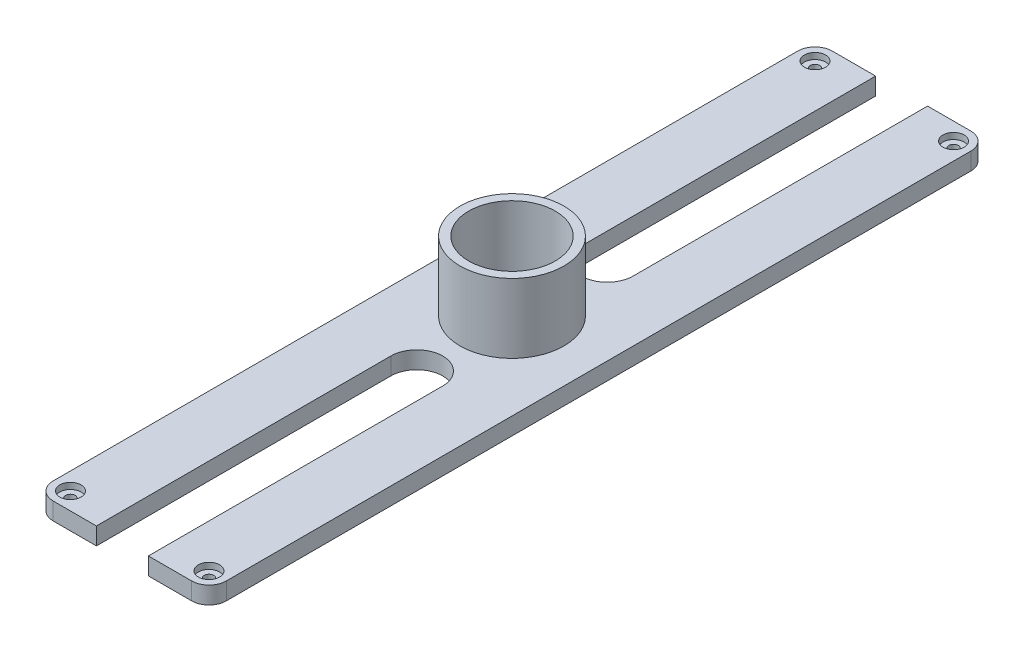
ISO-10303-21;
HEADER;
FILE_DESCRIPTION(('STEP AP214'),'2;1');
FILE_NAME('part.step','',(''),(''),'','','');
FILE_SCHEMA(('AUTOMOTIVE_DESIGN { 1 0 10303 214 1 1 1 1 }'));
ENDSEC;
DATA;
#1=APPLICATION_CONTEXT('core data for automotive mechanical design processes');
#2=APPLICATION_PROTOCOL_DEFINITION('international standard','automotive_design',2000,#1);
#3=PRODUCT_CONTEXT('',#1,'mechanical');
#4=PRODUCT('Part','Part','',(#3));
#5=PRODUCT_RELATED_PRODUCT_CATEGORY('part','',(#4));
#6=PRODUCT_DEFINITION_FORMATION('','',#4);
#7=PRODUCT_DEFINITION_CONTEXT('part definition',#1,'design');
#8=PRODUCT_DEFINITION('design','',#6,#7);
#9=PRODUCT_DEFINITION_SHAPE('','',#8);
#10=(LENGTH_UNIT() NAMED_UNIT(*) SI_UNIT(.MILLI.,.METRE.));
#11=(NAMED_UNIT(*) PLANE_ANGLE_UNIT() SI_UNIT($,.RADIAN.));
#12=(NAMED_UNIT(*) SI_UNIT($,.STERADIAN.) SOLID_ANGLE_UNIT());
#13=UNCERTAINTY_MEASURE_WITH_UNIT(LENGTH_MEASURE(1.E-05),#10,'distance_accuracy_value','');
#14=(GEOMETRIC_REPRESENTATION_CONTEXT(3) GLOBAL_UNCERTAINTY_ASSIGNED_CONTEXT((#13)) GLOBAL_UNIT_ASSIGNED_CONTEXT((#10,
#11,#12)) REPRESENTATION_CONTEXT('',''));
#15=CARTESIAN_POINT('',(0.,0.,0.));
#16=DIRECTION('',(0.,0.,1.));
#17=DIRECTION('',(1.,0.,0.));
#18=AXIS2_PLACEMENT_3D('',#15,#16,#17);
#19=CARTESIAN_POINT('',(10.,10.,450.));
#20=DIRECTION('',(0.,0.,-1.));
#21=DIRECTION('',(-1.,0.,0.));
#22=AXIS2_PLACEMENT_3D('',#19,#20,#21);
#23=PLANE('',#22);
#24=DIRECTION('',(1.,0.,0.));
#25=VECTOR('',#24,1.);
#26=CARTESIAN_POINT('',(10.,10.,450.));
#27=LINE('',#26,#25);
#28=CARTESIAN_POINT('',(65.,10.,450.));
#29=VERTEX_POINT('',#28);
#30=CARTESIAN_POINT('',(90.0000000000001,10.,450.));
#31=VERTEX_POINT('',#30);
#32=EDGE_CURVE('E292',#29,#31,#27,.T.);
#33=ORIENTED_EDGE('',*,*,#32,.F.);
#34=DIRECTION('',(0.,1.,0.));
#35=VECTOR('',#34,1.);
#36=CARTESIAN_POINT('',(65.,-0.000999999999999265,450.));
#37=LINE('',#36,#35);
#38=CARTESIAN_POINT('',(65.,0.,450.));
#39=VERTEX_POINT('',#38);
#40=EDGE_CURVE('E176',#39,#29,#37,.T.);
#41=ORIENTED_EDGE('',*,*,#40,.F.);
#42=DIRECTION('',(1.,0.,0.));
#43=VECTOR('',#42,1.);
#44=CARTESIAN_POINT('',(10.,0.,450.));
#45=LINE('',#44,#43);
#46=CARTESIAN_POINT('',(90.0000000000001,0.,450.));
#47=VERTEX_POINT('',#46);
#48=EDGE_CURVE('E272',#39,#47,#45,.T.);
#49=ORIENTED_EDGE('',*,*,#48,.T.);
#50=DIRECTION('',(0.,-1.,0.));
#51=VECTOR('',#50,1.);
#52=CARTESIAN_POINT('',(90.0000000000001,10.,450.));
#53=LINE('',#52,#51);
#54=EDGE_CURVE('E306',#31,#47,#53,.T.);
#55=ORIENTED_EDGE('',*,*,#54,.F.);
#56=EDGE_LOOP('',(#33,#41,#49,#55));
#57=FACE_BOUND('',#56,.T.);
#58=ADVANCED_FACE('F33',(#57),#23,.F.);
#59=CARTESIAN_POINT('',(89.9999999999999,10.,0.));
#60=DIRECTION('',(0.,0.,1.));
#61=DIRECTION('',(1.,0.,0.));
#62=AXIS2_PLACEMENT_3D('',#59,#60,#61);
#63=PLANE('',#62);
#64=DIRECTION('',(-1.,0.,0.));
#65=VECTOR('',#64,1.);
#66=CARTESIAN_POINT('',(89.9999999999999,0.,0.));
#67=LINE('',#66,#65);
#68=CARTESIAN_POINT('',(89.9999999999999,0.,0.));
#69=VERTEX_POINT('',#68);
#70=CARTESIAN_POINT('',(65.,0.,0.));
#71=VERTEX_POINT('',#70);
#72=EDGE_CURVE('E263',#69,#71,#67,.T.);
#73=ORIENTED_EDGE('',*,*,#72,.T.);
#74=DIRECTION('',(0.,1.,0.));
#75=VECTOR('',#74,1.);
#76=CARTESIAN_POINT('',(65.,-0.000999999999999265,0.));
#77=LINE('',#76,#75);
#78=CARTESIAN_POINT('',(65.,10.,0.));
#79=VERTEX_POINT('',#78);
#80=EDGE_CURVE('E192',#71,#79,#77,.T.);
#81=ORIENTED_EDGE('',*,*,#80,.T.);
#82=DIRECTION('',(-1.,0.,0.));
#83=VECTOR('',#82,1.);
#84=CARTESIAN_POINT('',(89.9999999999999,10.,0.));
#85=LINE('',#84,#83);
#86=CARTESIAN_POINT('',(89.9999999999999,10.,0.));
#87=VERTEX_POINT('',#86);
#88=EDGE_CURVE('E283',#87,#79,#85,.T.);
#89=ORIENTED_EDGE('',*,*,#88,.F.);
#90=DIRECTION('',(0.,-1.,0.));
#91=VECTOR('',#90,1.);
#92=CARTESIAN_POINT('',(89.9999999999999,10.,0.));
#93=LINE('',#92,#91);
#94=EDGE_CURVE('E41',#87,#69,#93,.T.);
#95=ORIENTED_EDGE('',*,*,#94,.T.);
#96=EDGE_LOOP('',(#73,#81,#89,#95));
#97=FACE_BOUND('',#96,.T.);
#98=ADVANCED_FACE('F323',(#97),#63,.F.);
#99=CARTESIAN_POINT('',(90.,10.,9.99999999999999));
#100=DIRECTION('',(0.,1.,0.));
#101=DIRECTION('',(0.,0.,1.));
#102=AXIS2_PLACEMENT_3D('',#99,#100,#101);
#103=PLANE('',#102);
#104=DIRECTION('',(0.,0.,-1.));
#105=VECTOR('',#104,1.);
#106=CARTESIAN_POINT('',(65.,10.,280.));
#107=LINE('',#106,#105);
#108=CARTESIAN_POINT('',(65.,10.,280.));
#109=VERTEX_POINT('',#108);
#110=EDGE_CURVE('E155',#29,#109,#107,.T.);
#111=ORIENTED_EDGE('',*,*,#110,.F.);
#112=ORIENTED_EDGE('',*,*,#32,.T.);
#113=CARTESIAN_POINT('',(90.0000000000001,10.,440.));
#114=DIRECTION('',(0.,1.,0.));
#115=DIRECTION('',(0.,0.,1.));
#116=AXIS2_PLACEMENT_3D('',#113,#114,#115);
#117=CIRCLE('',#116,10.);
#118=CARTESIAN_POINT('',(100.,10.,440.));
#119=VERTEX_POINT('',#118);
#120=EDGE_CURVE('E296',#31,#119,#117,.T.);
#121=ORIENTED_EDGE('',*,*,#120,.T.);
#122=DIRECTION('',(0.,0.,-1.));
#123=VECTOR('',#122,1.);
#124=CARTESIAN_POINT('',(100.,10.,440.));
#125=LINE('',#124,#123);
#126=CARTESIAN_POINT('',(100.,10.,10.0000000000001));
#127=VERTEX_POINT('',#126);
#128=EDGE_CURVE('E298',#119,#127,#125,.T.);
#129=ORIENTED_EDGE('',*,*,#128,.T.);
#130=CARTESIAN_POINT('',(90.,10.,9.99999999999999));
#131=DIRECTION('',(0.,1.,0.));
#132=DIRECTION('',(0.,0.,1.));
#133=AXIS2_PLACEMENT_3D('',#130,#131,#132);
#134=CIRCLE('',#133,10.);
#135=EDGE_CURVE('E279',#127,#87,#134,.T.);
#136=ORIENTED_EDGE('',*,*,#135,.T.);
#137=ORIENTED_EDGE('',*,*,#88,.T.);
#138=DIRECTION('',(0.,0.,-1.));
#139=VECTOR('',#138,1.);
#140=CARTESIAN_POINT('',(65.,10.,170.));
#141=LINE('',#140,#139);
#142=CARTESIAN_POINT('',(65.,10.,170.));
#143=VERTEX_POINT('',#142);
#144=EDGE_CURVE('E189',#143,#79,#141,.T.);
#145=ORIENTED_EDGE('',*,*,#144,.F.);
#146=CARTESIAN_POINT('',(50.,10.,170.));
#147=DIRECTION('',(0.,1.,0.));
#148=DIRECTION('',(0.,0.,1.));
#149=AXIS2_PLACEMENT_3D('',#146,#147,#148);
#150=CIRCLE('',#149,15.);
#151=CARTESIAN_POINT('',(35.,10.,170.));
#152=VERTEX_POINT('',#151);
#153=EDGE_CURVE('E186',#152,#143,#150,.T.);
#154=ORIENTED_EDGE('',*,*,#153,.F.);
#155=DIRECTION('',(0.,0.,1.));
#156=VECTOR('',#155,1.);
#157=CARTESIAN_POINT('',(35.,10.,0.));
#158=LINE('',#157,#156);
#159=CARTESIAN_POINT('',(35.,10.,0.));
#160=VERTEX_POINT('',#159);
#161=EDGE_CURVE('E183',#160,#152,#158,.T.);
#162=ORIENTED_EDGE('',*,*,#161,.F.);
#163=CARTESIAN_POINT('',(10.0000000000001,10.,0.));
#164=VERTEX_POINT('',#163);
#165=EDGE_CURVE('E282',#160,#164,#85,.T.);
#166=ORIENTED_EDGE('',*,*,#165,.T.);
#167=CARTESIAN_POINT('',(10.,10.,10.));
#168=DIRECTION('',(0.,1.,0.));
#169=DIRECTION('',(0.,0.,-1.));
#170=AXIS2_PLACEMENT_3D('',#167,#168,#169);
#171=CIRCLE('',#170,10.);
#172=CARTESIAN_POINT('',(0.,10.,10.0000000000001));
#173=VERTEX_POINT('',#172);
#174=EDGE_CURVE('E286',#164,#173,#171,.T.);
#175=ORIENTED_EDGE('',*,*,#174,.T.);
#176=DIRECTION('',(0.,0.,1.));
#177=VECTOR('',#176,1.);
#178=CARTESIAN_POINT('',(0.,10.,10.0000000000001));
#179=LINE('',#178,#177);
#180=CARTESIAN_POINT('',(0.,10.,440.));
#181=VERTEX_POINT('',#180);
#182=EDGE_CURVE('E288',#173,#181,#179,.T.);
#183=ORIENTED_EDGE('',*,*,#182,.T.);
#184=CARTESIAN_POINT('',(10.,10.,440.));
#185=DIRECTION('',(0.,1.,0.));
#186=DIRECTION('',(0.,0.,1.));
#187=AXIS2_PLACEMENT_3D('',#184,#185,#186);
#188=CIRCLE('',#187,10.);
#189=CARTESIAN_POINT('',(10.,10.,450.));
#190=VERTEX_POINT('',#189);
#191=EDGE_CURVE('E290',#181,#190,#188,.T.);
#192=ORIENTED_EDGE('',*,*,#191,.T.);
#193=CARTESIAN_POINT('',(35.0000000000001,10.,450.));
#194=VERTEX_POINT('',#193);
#195=EDGE_CURVE('E293',#190,#194,#27,.T.);
#196=ORIENTED_EDGE('',*,*,#195,.T.);
#197=DIRECTION('',(0.,0.,1.));
#198=VECTOR('',#197,1.);
#199=CARTESIAN_POINT('',(35.0000000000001,10.,450.));
#200=LINE('',#199,#198);
#201=CARTESIAN_POINT('',(35.,10.,280.));
#202=VERTEX_POINT('',#201);
#203=EDGE_CURVE('E171',#202,#194,#200,.T.);
#204=ORIENTED_EDGE('',*,*,#203,.F.);
#205=CARTESIAN_POINT('',(50.,10.,280.));
#206=DIRECTION('',(0.,1.,0.));
#207=DIRECTION('',(0.,0.,-1.));
#208=AXIS2_PLACEMENT_3D('',#205,#206,#207);
#209=CIRCLE('',#208,15.);
#210=EDGE_CURVE('E153',#109,#202,#209,.T.);
#211=ORIENTED_EDGE('',*,*,#210,.F.);
#212=EDGE_LOOP('',(#111,#112,#121,#129,#136,#137,#145,#154,#162,#166,#175,#183,#192,#196,#204,#211));
#213=FACE_BOUND('',#212,.T.);
#214=CARTESIAN_POINT('',(90.,10.,9.99999999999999));
#215=DIRECTION('',(0.,1.,0.));
#216=DIRECTION('',(0.,0.,1.));
#217=AXIS2_PLACEMENT_3D('',#214,#215,#216);
#218=CIRCLE('',#217,6.12);
#219=CARTESIAN_POINT('',(90.,10.,16.12));
#220=VERTEX_POINT('',#219);
#221=EDGE_CURVE('E211',#220,#220,#218,.T.);
#222=ORIENTED_EDGE('',*,*,#221,.F.);
#223=EDGE_LOOP('',(#222));
#224=FACE_BOUND('',#223,.T.);
#225=CARTESIAN_POINT('',(90.0000000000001,10.,440.));
#226=DIRECTION('',(0.,1.,0.));
#227=DIRECTION('',(0.,0.,1.));
#228=AXIS2_PLACEMENT_3D('',#225,#226,#227);
#229=CIRCLE('',#228,6.12);
#230=CARTESIAN_POINT('',(90.0000000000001,10.,446.12));
#231=VERTEX_POINT('',#230);
#232=EDGE_CURVE('E223',#231,#231,#229,.T.);
#233=ORIENTED_EDGE('',*,*,#232,.F.);
#234=EDGE_LOOP('',(#233));
#235=FACE_BOUND('',#234,.T.);
#236=CARTESIAN_POINT('',(10.,10.,440.));
#237=DIRECTION('',(0.,1.,0.));
#238=DIRECTION('',(0.,0.,1.));
#239=AXIS2_PLACEMENT_3D('',#236,#237,#238);
#240=CIRCLE('',#239,6.12);
#241=CARTESIAN_POINT('',(10.,10.,446.12));
#242=VERTEX_POINT('',#241);
#243=EDGE_CURVE('E235',#242,#242,#240,.T.);
#244=ORIENTED_EDGE('',*,*,#243,.F.);
#245=EDGE_LOOP('',(#244));
#246=FACE_BOUND('',#245,.T.);
#247=CARTESIAN_POINT('',(10.,10.,10.));
#248=DIRECTION('',(0.,1.,0.));
#249=DIRECTION('',(0.,0.,1.));
#250=AXIS2_PLACEMENT_3D('',#247,#248,#249);
#251=CIRCLE('',#250,6.12);
#252=CARTESIAN_POINT('',(10.,10.,16.12));
#253=VERTEX_POINT('',#252);
#254=EDGE_CURVE('E247',#253,#253,#251,.T.);
#255=ORIENTED_EDGE('',*,*,#254,.F.);
#256=EDGE_LOOP('',(#255));
#257=FACE_BOUND('',#256,.T.);
#258=CARTESIAN_POINT('',(50.,10.,225.));
#259=DIRECTION('',(0.,1.,0.));
#260=DIRECTION('',(0.,0.,1.));
#261=AXIS2_PLACEMENT_3D('',#258,#259,#260);
#262=CIRCLE('',#261,30.);
#263=CARTESIAN_POINT('',(50.,10.,255.));
#264=VERTEX_POINT('',#263);
#265=EDGE_CURVE('E205',#264,#264,#262,.T.);
#266=ORIENTED_EDGE('',*,*,#265,.F.);
#267=EDGE_LOOP('',(#266));
#268=FACE_BOUND('',#267,.T.);
#269=ADVANCED_FACE('F337',(#213,#224,#235,#246,#257,#268),#103,.T.);
#270=CARTESIAN_POINT('',(90.,10.,9.99999999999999));
#271=DIRECTION('',(0.,-1.,0.));
#272=DIRECTION('',(0.,0.,-1.));
#273=AXIS2_PLACEMENT_3D('',#270,#271,#272);
#274=CYLINDRICAL_SURFACE('',#273,10.);
#275=CARTESIAN_POINT('',(90.,0.,9.99999999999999));
#276=DIRECTION('',(0.,1.,0.));
#277=DIRECTION('',(0.,0.,1.));
#278=AXIS2_PLACEMENT_3D('',#275,#276,#277);
#279=CIRCLE('',#278,10.);
#280=CARTESIAN_POINT('',(100.,0.,10.0000000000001));
#281=VERTEX_POINT('',#280);
#282=EDGE_CURVE('E259',#281,#69,#279,.T.);
#283=ORIENTED_EDGE('',*,*,#282,.T.);
#284=ORIENTED_EDGE('',*,*,#94,.F.);
#285=ORIENTED_EDGE('',*,*,#135,.F.);
#286=DIRECTION('',(0.,-1.,0.));
#287=VECTOR('',#286,1.);
#288=CARTESIAN_POINT('',(100.,10.,10.0000000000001));
#289=LINE('',#288,#287);
#290=EDGE_CURVE('E300',#127,#281,#289,.T.);
#291=ORIENTED_EDGE('',*,*,#290,.T.);
#292=EDGE_LOOP('',(#283,#284,#285,#291));
#293=FACE_BOUND('',#292,.T.);
#294=ADVANCED_FACE('F35',(#293),#274,.T.);
#295=ORIENTED_EDGE('',*,*,#165,.F.);
#296=DIRECTION('',(0.,1.,0.));
#297=VECTOR('',#296,1.);
#298=CARTESIAN_POINT('',(35.,-0.000999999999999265,0.));
#299=LINE('',#298,#297);
#300=CARTESIAN_POINT('',(35.,0.,0.));
#301=VERTEX_POINT('',#300);
#302=EDGE_CURVE('E191',#301,#160,#299,.T.);
#303=ORIENTED_EDGE('',*,*,#302,.F.);
#304=CARTESIAN_POINT('',(10.0000000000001,0.,0.));
#305=VERTEX_POINT('',#304);
#306=EDGE_CURVE('E262',#301,#305,#67,.T.);
#307=ORIENTED_EDGE('',*,*,#306,.T.);
#308=DIRECTION('',(0.,-1.,0.));
#309=VECTOR('',#308,1.);
#310=CARTESIAN_POINT('',(10.0000000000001,10.,0.));
#311=LINE('',#310,#309);
#312=EDGE_CURVE('E318',#164,#305,#311,.T.);
#313=ORIENTED_EDGE('',*,*,#312,.F.);
#314=EDGE_LOOP('',(#295,#303,#307,#313));
#315=FACE_BOUND('',#314,.T.);
#316=ADVANCED_FACE('F376',(#315),#63,.F.);
#317=CARTESIAN_POINT('',(10.,10.,10.));
#318=DIRECTION('',(0.,-1.,0.));
#319=DIRECTION('',(0.,0.,-1.));
#320=AXIS2_PLACEMENT_3D('',#317,#318,#319);
#321=CYLINDRICAL_SURFACE('',#320,10.);
#322=CARTESIAN_POINT('',(10.,0.,10.));
#323=DIRECTION('',(0.,1.,0.));
#324=DIRECTION('',(0.,0.,-1.));
#325=AXIS2_PLACEMENT_3D('',#322,#323,#324);
#326=CIRCLE('',#325,10.);
#327=CARTESIAN_POINT('',(0.,0.,10.0000000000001));
#328=VERTEX_POINT('',#327);
#329=EDGE_CURVE('E266',#305,#328,#326,.T.);
#330=ORIENTED_EDGE('',*,*,#329,.T.);
#331=DIRECTION('',(0.,-1.,0.));
#332=VECTOR('',#331,1.);
#333=CARTESIAN_POINT('',(0.,10.,10.0000000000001));
#334=LINE('',#333,#332);
#335=EDGE_CURVE('E315',#173,#328,#334,.T.);
#336=ORIENTED_EDGE('',*,*,#335,.F.);
#337=ORIENTED_EDGE('',*,*,#174,.F.);
#338=ORIENTED_EDGE('',*,*,#312,.T.);
#339=EDGE_LOOP('',(#330,#336,#337,#338));
#340=FACE_BOUND('',#339,.T.);
#341=ADVANCED_FACE('F370',(#340),#321,.T.);
#342=CARTESIAN_POINT('',(0.,10.,10.0000000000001));
#343=DIRECTION('',(1.,0.,0.));
#344=DIRECTION('',(0.,0.,-1.));
#345=AXIS2_PLACEMENT_3D('',#342,#343,#344);
#346=PLANE('',#345);
#347=DIRECTION('',(0.,0.,1.));
#348=VECTOR('',#347,1.);
#349=CARTESIAN_POINT('',(0.,0.,10.0000000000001));
#350=LINE('',#349,#348);
#351=CARTESIAN_POINT('',(0.,0.,440.));
#352=VERTEX_POINT('',#351);
#353=EDGE_CURVE('E268',#328,#352,#350,.T.);
#354=ORIENTED_EDGE('',*,*,#353,.T.);
#355=DIRECTION('',(0.,-1.,0.));
#356=VECTOR('',#355,1.);
#357=CARTESIAN_POINT('',(0.,10.,440.));
#358=LINE('',#357,#356);
#359=EDGE_CURVE('E312',#181,#352,#358,.T.);
#360=ORIENTED_EDGE('',*,*,#359,.F.);
#361=ORIENTED_EDGE('',*,*,#182,.F.);
#362=ORIENTED_EDGE('',*,*,#335,.T.);
#363=EDGE_LOOP('',(#354,#360,#361,#362));
#364=FACE_BOUND('',#363,.T.);
#365=ADVANCED_FACE('F366',(#364),#346,.F.);
#366=CARTESIAN_POINT('',(10.,10.,440.));
#367=DIRECTION('',(0.,-1.,0.));
#368=DIRECTION('',(0.,0.,-1.));
#369=AXIS2_PLACEMENT_3D('',#366,#367,#368);
#370=CYLINDRICAL_SURFACE('',#369,10.);
#371=CARTESIAN_POINT('',(10.,0.,440.));
#372=DIRECTION('',(0.,1.,0.));
#373=DIRECTION('',(0.,0.,1.));
#374=AXIS2_PLACEMENT_3D('',#371,#372,#373);
#375=CIRCLE('',#374,10.);
#376=CARTESIAN_POINT('',(10.,0.,450.));
#377=VERTEX_POINT('',#376);
#378=EDGE_CURVE('E270',#352,#377,#375,.T.);
#379=ORIENTED_EDGE('',*,*,#378,.T.);
#380=DIRECTION('',(0.,-1.,0.));
#381=VECTOR('',#380,1.);
#382=CARTESIAN_POINT('',(10.,10.,450.));
#383=LINE('',#382,#381);
#384=EDGE_CURVE('E309',#190,#377,#383,.T.);
#385=ORIENTED_EDGE('',*,*,#384,.F.);
#386=ORIENTED_EDGE('',*,*,#191,.F.);
#387=ORIENTED_EDGE('',*,*,#359,.T.);
#388=EDGE_LOOP('',(#379,#385,#386,#387));
#389=FACE_BOUND('',#388,.T.);
#390=ADVANCED_FACE('F361',(#389),#370,.T.);
#391=CARTESIAN_POINT('',(35.,0.,450.));
#392=VERTEX_POINT('',#391);
#393=EDGE_CURVE('E273',#377,#392,#45,.T.);
#394=ORIENTED_EDGE('',*,*,#393,.T.);
#395=DIRECTION('',(0.,1.,0.));
#396=VECTOR('',#395,1.);
#397=CARTESIAN_POINT('',(35.0000000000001,-0.000999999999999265,450.));
#398=LINE('',#397,#396);
#399=EDGE_CURVE('E48',#392,#194,#398,.T.);
#400=ORIENTED_EDGE('',*,*,#399,.T.);
#401=ORIENTED_EDGE('',*,*,#195,.F.);
#402=ORIENTED_EDGE('',*,*,#384,.T.);
#403=EDGE_LOOP('',(#394,#400,#401,#402));
#404=FACE_BOUND('',#403,.T.);
#405=ADVANCED_FACE('F355',(#404),#23,.F.);
#406=CARTESIAN_POINT('',(90.0000000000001,10.,440.));
#407=DIRECTION('',(0.,-1.,0.));
#408=DIRECTION('',(0.,0.,-1.));
#409=AXIS2_PLACEMENT_3D('',#406,#407,#408);
#410=CYLINDRICAL_SURFACE('',#409,10.);
#411=CARTESIAN_POINT('',(90.0000000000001,0.,440.));
#412=DIRECTION('',(0.,1.,0.));
#413=DIRECTION('',(0.,0.,1.));
#414=AXIS2_PLACEMENT_3D('',#411,#412,#413);
#415=CIRCLE('',#414,10.);
#416=CARTESIAN_POINT('',(100.,0.,440.));
#417=VERTEX_POINT('',#416);
#418=EDGE_CURVE('E275',#47,#417,#415,.T.);
#419=ORIENTED_EDGE('',*,*,#418,.T.);
#420=DIRECTION('',(0.,-1.,0.));
#421=VECTOR('',#420,1.);
#422=CARTESIAN_POINT('',(100.,10.,440.));
#423=LINE('',#422,#421);
#424=EDGE_CURVE('E303',#119,#417,#423,.T.);
#425=ORIENTED_EDGE('',*,*,#424,.F.);
#426=ORIENTED_EDGE('',*,*,#120,.F.);
#427=ORIENTED_EDGE('',*,*,#54,.T.);
#428=EDGE_LOOP('',(#419,#425,#426,#427));
#429=FACE_BOUND('',#428,.T.);
#430=ADVANCED_FACE('F346',(#429),#410,.T.);
#431=CARTESIAN_POINT('',(100.,10.,440.));
#432=DIRECTION('',(-1.,0.,0.));
#433=DIRECTION('',(0.,0.,1.));
#434=AXIS2_PLACEMENT_3D('',#431,#432,#433);
#435=PLANE('',#434);
#436=DIRECTION('',(0.,0.,-1.));
#437=VECTOR('',#436,1.);
#438=CARTESIAN_POINT('',(100.,0.,440.));
#439=LINE('',#438,#437);
#440=EDGE_CURVE('E277',#417,#281,#439,.T.);
#441=ORIENTED_EDGE('',*,*,#440,.T.);
#442=ORIENTED_EDGE('',*,*,#290,.F.);
#443=ORIENTED_EDGE('',*,*,#128,.F.);
#444=ORIENTED_EDGE('',*,*,#424,.T.);
#445=EDGE_LOOP('',(#441,#442,#443,#444));
#446=FACE_BOUND('',#445,.T.);
#447=ADVANCED_FACE('F344',(#446),#435,.F.);
#448=CARTESIAN_POINT('',(90.,0.,9.99999999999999));
#449=DIRECTION('',(0.,1.,0.));
#450=DIRECTION('',(0.,0.,1.));
#451=AXIS2_PLACEMENT_3D('',#448,#449,#450);
#452=PLANE('',#451);
#453=CARTESIAN_POINT('',(90.,0.,9.99999999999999));
#454=DIRECTION('',(0.,1.,0.));
#455=DIRECTION('',(0.,0.,1.));
#456=AXIS2_PLACEMENT_3D('',#453,#454,#455);
#457=CIRCLE('',#456,2.75);
#458=CARTESIAN_POINT('',(90.,0.,12.75));
#459=VERTEX_POINT('',#458);
#460=EDGE_CURVE('E220',#459,#459,#457,.T.);
#461=ORIENTED_EDGE('',*,*,#460,.T.);
#462=EDGE_LOOP('',(#461));
#463=FACE_BOUND('',#462,.T.);
#464=CARTESIAN_POINT('',(90.0000000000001,0.,440.));
#465=DIRECTION('',(0.,1.,0.));
#466=DIRECTION('',(0.,0.,1.));
#467=AXIS2_PLACEMENT_3D('',#464,#465,#466);
#468=CIRCLE('',#467,2.75);
#469=CARTESIAN_POINT('',(90.0000000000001,0.,442.75));
#470=VERTEX_POINT('',#469);
#471=EDGE_CURVE('E232',#470,#470,#468,.T.);
#472=ORIENTED_EDGE('',*,*,#471,.T.);
#473=EDGE_LOOP('',(#472));
#474=FACE_BOUND('',#473,.T.);
#475=CARTESIAN_POINT('',(10.,0.,440.));
#476=DIRECTION('',(0.,1.,0.));
#477=DIRECTION('',(0.,0.,1.));
#478=AXIS2_PLACEMENT_3D('',#475,#476,#477);
#479=CIRCLE('',#478,2.75);
#480=CARTESIAN_POINT('',(10.,0.,442.75));
#481=VERTEX_POINT('',#480);
#482=EDGE_CURVE('E244',#481,#481,#479,.T.);
#483=ORIENTED_EDGE('',*,*,#482,.T.);
#484=EDGE_LOOP('',(#483));
#485=FACE_BOUND('',#484,.T.);
#486=CARTESIAN_POINT('',(10.,0.,10.));
#487=DIRECTION('',(0.,1.,0.));
#488=DIRECTION('',(0.,0.,1.));
#489=AXIS2_PLACEMENT_3D('',#486,#487,#488);
#490=CIRCLE('',#489,2.75);
#491=CARTESIAN_POINT('',(10.,0.,12.75));
#492=VERTEX_POINT('',#491);
#493=EDGE_CURVE('E256',#492,#492,#490,.T.);
#494=ORIENTED_EDGE('',*,*,#493,.T.);
#495=EDGE_LOOP('',(#494));
#496=FACE_BOUND('',#495,.T.);
#497=ORIENTED_EDGE('',*,*,#48,.F.);
#498=DIRECTION('',(0.,0.,1.));
#499=VECTOR('',#498,1.);
#500=CARTESIAN_POINT('',(65.,0.,280.));
#501=LINE('',#500,#499);
#502=CARTESIAN_POINT('',(65.,0.,280.));
#503=VERTEX_POINT('',#502);
#504=EDGE_CURVE('E166',#503,#39,#501,.T.);
#505=ORIENTED_EDGE('',*,*,#504,.F.);
#506=CARTESIAN_POINT('',(50.,0.,280.));
#507=DIRECTION('',(0.,1.,0.));
#508=DIRECTION('',(0.,0.,1.));
#509=AXIS2_PLACEMENT_3D('',#506,#507,#508);
#510=CIRCLE('',#509,15.);
#511=CARTESIAN_POINT('',(35.,0.,280.));
#512=VERTEX_POINT('',#511);
#513=EDGE_CURVE('E150',#512,#503,#510,.F.);
#514=ORIENTED_EDGE('',*,*,#513,.F.);
#515=DIRECTION('',(0.,0.,-1.));
#516=VECTOR('',#515,1.);
#517=CARTESIAN_POINT('',(35.0000000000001,0.,450.));
#518=LINE('',#517,#516);
#519=EDGE_CURVE('E157',#392,#512,#518,.T.);
#520=ORIENTED_EDGE('',*,*,#519,.F.);
#521=ORIENTED_EDGE('',*,*,#393,.F.);
#522=ORIENTED_EDGE('',*,*,#378,.F.);
#523=ORIENTED_EDGE('',*,*,#353,.F.);
#524=ORIENTED_EDGE('',*,*,#329,.F.);
#525=ORIENTED_EDGE('',*,*,#306,.F.);
#526=DIRECTION('',(0.,0.,-1.));
#527=VECTOR('',#526,1.);
#528=CARTESIAN_POINT('',(35.,0.,0.));
#529=LINE('',#528,#527);
#530=CARTESIAN_POINT('',(35.,0.,170.));
#531=VERTEX_POINT('',#530);
#532=EDGE_CURVE('E195',#531,#301,#529,.T.);
#533=ORIENTED_EDGE('',*,*,#532,.F.);
#534=CARTESIAN_POINT('',(50.,0.,170.));
#535=DIRECTION('',(0.,1.,0.));
#536=DIRECTION('',(0.,0.,1.));
#537=AXIS2_PLACEMENT_3D('',#534,#535,#536);
#538=CIRCLE('',#537,15.);
#539=CARTESIAN_POINT('',(65.,0.,170.));
#540=VERTEX_POINT('',#539);
#541=EDGE_CURVE('E56',#540,#531,#538,.F.);
#542=ORIENTED_EDGE('',*,*,#541,.F.);
#543=DIRECTION('',(0.,0.,1.));
#544=VECTOR('',#543,1.);
#545=CARTESIAN_POINT('',(65.,0.,170.));
#546=LINE('',#545,#544);
#547=EDGE_CURVE('E180',#71,#540,#546,.T.);
#548=ORIENTED_EDGE('',*,*,#547,.F.);
#549=ORIENTED_EDGE('',*,*,#72,.F.);
#550=ORIENTED_EDGE('',*,*,#282,.F.);
#551=ORIENTED_EDGE('',*,*,#440,.F.);
#552=ORIENTED_EDGE('',*,*,#418,.F.);
#553=EDGE_LOOP('',(#497,#505,#514,#520,#521,#522,#523,#524,#525,#533,#542,#548,#549,#550,#551,#552));
#554=FACE_BOUND('',#553,.T.);
#555=ADVANCED_FACE('F165',(#463,#474,#485,#496,#554),#452,.F.);
#556=CARTESIAN_POINT('',(10.,10.,10.));
#557=DIRECTION('',(0.,1.,0.));
#558=DIRECTION('',(0.,0.,1.));
#559=AXIS2_PLACEMENT_3D('',#556,#557,#558);
#560=CYLINDRICAL_SURFACE('',#559,2.75);
#561=ORIENTED_EDGE('',*,*,#493,.F.);
#562=EDGE_LOOP('',(#561));
#563=FACE_BOUND('',#562,.T.);
#564=CARTESIAN_POINT('',(10.,6.42,10.));
#565=DIRECTION('',(0.,1.,0.));
#566=DIRECTION('',(0.,0.,1.));
#567=AXIS2_PLACEMENT_3D('',#564,#565,#566);
#568=CIRCLE('',#567,2.75000000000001);
#569=CARTESIAN_POINT('',(10.,6.42,12.75));
#570=VERTEX_POINT('',#569);
#571=EDGE_CURVE('E253',#570,#570,#568,.T.);
#572=ORIENTED_EDGE('',*,*,#571,.T.);
#573=EDGE_LOOP('',(#572));
#574=FACE_BOUND('',#573,.T.);
#575=ADVANCED_FACE('F484',(#563,#574),#560,.F.);
#576=CARTESIAN_POINT('',(12.75,6.42,10.));
#577=DIRECTION('',(0.,-1.,0.));
#578=DIRECTION('',(0.,0.,-1.));
#579=AXIS2_PLACEMENT_3D('',#576,#577,#578);
#580=PLANE('',#579);
#581=ORIENTED_EDGE('',*,*,#571,.F.);
#582=EDGE_LOOP('',(#581));
#583=FACE_BOUND('',#582,.T.);
#584=CARTESIAN_POINT('',(10.,6.42,10.));
#585=DIRECTION('',(0.,1.,0.));
#586=DIRECTION('',(0.,0.,1.));
#587=AXIS2_PLACEMENT_3D('',#584,#585,#586);
#588=CIRCLE('',#587,6.11999999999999);
#589=CARTESIAN_POINT('',(10.,6.42,16.12));
#590=VERTEX_POINT('',#589);
#591=EDGE_CURVE('E250',#590,#590,#588,.T.);
#592=ORIENTED_EDGE('',*,*,#591,.T.);
#593=EDGE_LOOP('',(#592));
#594=FACE_BOUND('',#593,.T.);
#595=ADVANCED_FACE('F480',(#583,#594),#580,.F.);
#596=CARTESIAN_POINT('',(10.,10.,10.));
#597=DIRECTION('',(0.,1.,0.));
#598=DIRECTION('',(0.,0.,1.));
#599=AXIS2_PLACEMENT_3D('',#596,#597,#598);
#600=CYLINDRICAL_SURFACE('',#599,6.12);
#601=ORIENTED_EDGE('',*,*,#591,.F.);
#602=EDGE_LOOP('',(#601));
#603=FACE_BOUND('',#602,.T.);
#604=ORIENTED_EDGE('',*,*,#254,.T.);
#605=EDGE_LOOP('',(#604));
#606=FACE_BOUND('',#605,.T.);
#607=ADVANCED_FACE('F476',(#603,#606),#600,.F.);
#608=CARTESIAN_POINT('',(10.,10.,440.));
#609=DIRECTION('',(0.,1.,0.));
#610=DIRECTION('',(0.,0.,1.));
#611=AXIS2_PLACEMENT_3D('',#608,#609,#610);
#612=CYLINDRICAL_SURFACE('',#611,2.75);
#613=ORIENTED_EDGE('',*,*,#482,.F.);
#614=EDGE_LOOP('',(#613));
#615=FACE_BOUND('',#614,.T.);
#616=CARTESIAN_POINT('',(10.,6.42,440.));
#617=DIRECTION('',(0.,1.,0.));
#618=DIRECTION('',(0.,0.,1.));
#619=AXIS2_PLACEMENT_3D('',#616,#617,#618);
#620=CIRCLE('',#619,2.75000000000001);
#621=CARTESIAN_POINT('',(10.,6.42,442.75));
#622=VERTEX_POINT('',#621);
#623=EDGE_CURVE('E241',#622,#622,#620,.T.);
#624=ORIENTED_EDGE('',*,*,#623,.T.);
#625=EDGE_LOOP('',(#624));
#626=FACE_BOUND('',#625,.T.);
#627=ADVANCED_FACE('F472',(#615,#626),#612,.F.);
#628=CARTESIAN_POINT('',(12.75,6.42,440.));
#629=DIRECTION('',(0.,-1.,0.));
#630=DIRECTION('',(0.,0.,-1.));
#631=AXIS2_PLACEMENT_3D('',#628,#629,#630);
#632=PLANE('',#631);
#633=ORIENTED_EDGE('',*,*,#623,.F.);
#634=EDGE_LOOP('',(#633));
#635=FACE_BOUND('',#634,.T.);
#636=CARTESIAN_POINT('',(10.,6.42,440.));
#637=DIRECTION('',(0.,1.,0.));
#638=DIRECTION('',(0.,0.,1.));
#639=AXIS2_PLACEMENT_3D('',#636,#637,#638);
#640=CIRCLE('',#639,6.12);
#641=CARTESIAN_POINT('',(10.,6.42,446.12));
#642=VERTEX_POINT('',#641);
#643=EDGE_CURVE('E238',#642,#642,#640,.T.);
#644=ORIENTED_EDGE('',*,*,#643,.T.);
#645=EDGE_LOOP('',(#644));
#646=FACE_BOUND('',#645,.T.);
#647=ADVANCED_FACE('F468',(#635,#646),#632,.F.);
#648=CARTESIAN_POINT('',(10.,10.,440.));
#649=DIRECTION('',(0.,1.,0.));
#650=DIRECTION('',(0.,0.,1.));
#651=AXIS2_PLACEMENT_3D('',#648,#649,#650);
#652=CYLINDRICAL_SURFACE('',#651,6.12);
#653=ORIENTED_EDGE('',*,*,#643,.F.);
#654=EDGE_LOOP('',(#653));
#655=FACE_BOUND('',#654,.T.);
#656=ORIENTED_EDGE('',*,*,#243,.T.);
#657=EDGE_LOOP('',(#656));
#658=FACE_BOUND('',#657,.T.);
#659=ADVANCED_FACE('F464',(#655,#658),#652,.F.);
#660=CARTESIAN_POINT('',(90.0000000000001,10.,440.));
#661=DIRECTION('',(0.,1.,0.));
#662=DIRECTION('',(0.,0.,1.));
#663=AXIS2_PLACEMENT_3D('',#660,#661,#662);
#664=CYLINDRICAL_SURFACE('',#663,2.75000000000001);
#665=ORIENTED_EDGE('',*,*,#471,.F.);
#666=EDGE_LOOP('',(#665));
#667=FACE_BOUND('',#666,.T.);
#668=CARTESIAN_POINT('',(90.0000000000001,6.42,440.));
#669=DIRECTION('',(0.,1.,0.));
#670=DIRECTION('',(0.,0.,1.));
#671=AXIS2_PLACEMENT_3D('',#668,#669,#670);
#672=CIRCLE('',#671,2.75000000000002);
#673=CARTESIAN_POINT('',(90.0000000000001,6.42,442.75));
#674=VERTEX_POINT('',#673);
#675=EDGE_CURVE('E229',#674,#674,#672,.T.);
#676=ORIENTED_EDGE('',*,*,#675,.T.);
#677=EDGE_LOOP('',(#676));
#678=FACE_BOUND('',#677,.T.);
#679=ADVANCED_FACE('F460',(#667,#678),#664,.F.);
#680=CARTESIAN_POINT('',(92.7500000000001,6.42,440.));
#681=DIRECTION('',(0.,-1.,0.));
#682=DIRECTION('',(0.,0.,-1.));
#683=AXIS2_PLACEMENT_3D('',#680,#681,#682);
#684=PLANE('',#683);
#685=ORIENTED_EDGE('',*,*,#675,.F.);
#686=EDGE_LOOP('',(#685));
#687=FACE_BOUND('',#686,.T.);
#688=CARTESIAN_POINT('',(90.0000000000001,6.42,440.));
#689=DIRECTION('',(0.,1.,0.));
#690=DIRECTION('',(0.,0.,1.));
#691=AXIS2_PLACEMENT_3D('',#688,#689,#690);
#692=CIRCLE('',#691,6.12);
#693=CARTESIAN_POINT('',(90.0000000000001,6.42,446.12));
#694=VERTEX_POINT('',#693);
#695=EDGE_CURVE('E226',#694,#694,#692,.T.);
#696=ORIENTED_EDGE('',*,*,#695,.T.);
#697=EDGE_LOOP('',(#696));
#698=FACE_BOUND('',#697,.T.);
#699=ADVANCED_FACE('F456',(#687,#698),#684,.F.);
#700=CARTESIAN_POINT('',(90.0000000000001,10.,440.));
#701=DIRECTION('',(0.,1.,0.));
#702=DIRECTION('',(0.,0.,1.));
#703=AXIS2_PLACEMENT_3D('',#700,#701,#702);
#704=CYLINDRICAL_SURFACE('',#703,6.12);
#705=ORIENTED_EDGE('',*,*,#695,.F.);
#706=EDGE_LOOP('',(#705));
#707=FACE_BOUND('',#706,.T.);
#708=ORIENTED_EDGE('',*,*,#232,.T.);
#709=EDGE_LOOP('',(#708));
#710=FACE_BOUND('',#709,.T.);
#711=ADVANCED_FACE('F452',(#707,#710),#704,.F.);
#712=CARTESIAN_POINT('',(90.,10.,9.99999999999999));
#713=DIRECTION('',(0.,1.,0.));
#714=DIRECTION('',(0.,0.,1.));
#715=AXIS2_PLACEMENT_3D('',#712,#713,#714);
#716=CYLINDRICAL_SURFACE('',#715,2.75000000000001);
#717=ORIENTED_EDGE('',*,*,#460,.F.);
#718=EDGE_LOOP('',(#717));
#719=FACE_BOUND('',#718,.T.);
#720=CARTESIAN_POINT('',(90.,6.42,9.99999999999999));
#721=DIRECTION('',(0.,1.,0.));
#722=DIRECTION('',(0.,0.,1.));
#723=AXIS2_PLACEMENT_3D('',#720,#721,#722);
#724=CIRCLE('',#723,2.75000000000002);
#725=CARTESIAN_POINT('',(90.,6.42,12.75));
#726=VERTEX_POINT('',#725);
#727=EDGE_CURVE('E217',#726,#726,#724,.T.);
#728=ORIENTED_EDGE('',*,*,#727,.T.);
#729=EDGE_LOOP('',(#728));
#730=FACE_BOUND('',#729,.T.);
#731=ADVANCED_FACE('F448',(#719,#730),#716,.F.);
#732=CARTESIAN_POINT('',(92.75,6.42,9.99999999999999));
#733=DIRECTION('',(0.,-1.,0.));
#734=DIRECTION('',(0.,0.,-1.));
#735=AXIS2_PLACEMENT_3D('',#732,#733,#734);
#736=PLANE('',#735);
#737=ORIENTED_EDGE('',*,*,#727,.F.);
#738=EDGE_LOOP('',(#737));
#739=FACE_BOUND('',#738,.T.);
#740=CARTESIAN_POINT('',(90.,6.42,9.99999999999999));
#741=DIRECTION('',(0.,1.,0.));
#742=DIRECTION('',(0.,0.,1.));
#743=AXIS2_PLACEMENT_3D('',#740,#741,#742);
#744=CIRCLE('',#743,6.12);
#745=CARTESIAN_POINT('',(90.,6.42,16.12));
#746=VERTEX_POINT('',#745);
#747=EDGE_CURVE('E214',#746,#746,#744,.T.);
#748=ORIENTED_EDGE('',*,*,#747,.T.);
#749=EDGE_LOOP('',(#748));
#750=FACE_BOUND('',#749,.T.);
#751=ADVANCED_FACE('F444',(#739,#750),#736,.F.);
#752=CARTESIAN_POINT('',(90.,10.,9.99999999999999));
#753=DIRECTION('',(0.,1.,0.));
#754=DIRECTION('',(0.,0.,1.));
#755=AXIS2_PLACEMENT_3D('',#752,#753,#754);
#756=CYLINDRICAL_SURFACE('',#755,6.12);
#757=ORIENTED_EDGE('',*,*,#747,.F.);
#758=EDGE_LOOP('',(#757));
#759=FACE_BOUND('',#758,.T.);
#760=ORIENTED_EDGE('',*,*,#221,.T.);
#761=EDGE_LOOP('',(#760));
#762=FACE_BOUND('',#761,.T.);
#763=ADVANCED_FACE('F439',(#759,#762),#756,.F.);
#764=CARTESIAN_POINT('',(50.,50.,225.));
#765=DIRECTION('',(0.,1.,0.));
#766=DIRECTION('',(0.,0.,1.));
#767=AXIS2_PLACEMENT_3D('',#764,#765,#766);
#768=PLANE('',#767);
#769=CARTESIAN_POINT('',(50.,50.,225.));
#770=DIRECTION('',(0.,1.,0.));
#771=DIRECTION('',(0.,0.,1.));
#772=AXIS2_PLACEMENT_3D('',#769,#770,#771);
#773=CIRCLE('',#772,30.);
#774=CARTESIAN_POINT('',(50.,50.,255.));
#775=VERTEX_POINT('',#774);
#776=EDGE_CURVE('E208',#775,#775,#773,.T.);
#777=ORIENTED_EDGE('',*,*,#776,.T.);
#778=EDGE_LOOP('',(#777));
#779=FACE_BOUND('',#778,.T.);
#780=CARTESIAN_POINT('',(50.,50.,225.));
#781=DIRECTION('',(0.,1.,0.));
#782=DIRECTION('',(0.,0.,1.));
#783=AXIS2_PLACEMENT_3D('',#780,#781,#782);
#784=CIRCLE('',#783,25.);
#785=CARTESIAN_POINT('',(50.,50.,250.));
#786=VERTEX_POINT('',#785);
#787=EDGE_CURVE('E202',#786,#786,#784,.T.);
#788=ORIENTED_EDGE('',*,*,#787,.F.);
#789=EDGE_LOOP('',(#788));
#790=FACE_BOUND('',#789,.T.);
#791=ADVANCED_FACE('F434',(#779,#790),#768,.T.);
#792=CARTESIAN_POINT('',(50.,50.,225.));
#793=DIRECTION('',(0.,-1.,0.));
#794=DIRECTION('',(0.,0.,-1.));
#795=AXIS2_PLACEMENT_3D('',#792,#793,#794);
#796=CYLINDRICAL_SURFACE('',#795,30.);
#797=ORIENTED_EDGE('',*,*,#776,.F.);
#798=EDGE_LOOP('',(#797));
#799=FACE_BOUND('',#798,.T.);
#800=ORIENTED_EDGE('',*,*,#265,.T.);
#801=EDGE_LOOP('',(#800));
#802=FACE_BOUND('',#801,.T.);
#803=ADVANCED_FACE('F426',(#799,#802),#796,.T.);
#804=CARTESIAN_POINT('',(50.,50.,225.));
#805=DIRECTION('',(0.,-1.,0.));
#806=DIRECTION('',(0.,0.,-1.));
#807=AXIS2_PLACEMENT_3D('',#804,#805,#806);
#808=CYLINDRICAL_SURFACE('',#807,25.);
#809=ORIENTED_EDGE('',*,*,#787,.T.);
#810=EDGE_LOOP('',(#809));
#811=FACE_BOUND('',#810,.T.);
#812=CARTESIAN_POINT('',(50.,10.,225.));
#813=DIRECTION('',(0.,1.,0.));
#814=DIRECTION('',(0.,0.,1.));
#815=AXIS2_PLACEMENT_3D('',#812,#813,#814);
#816=CIRCLE('',#815,25.);
#817=CARTESIAN_POINT('',(50.,10.,250.));
#818=VERTEX_POINT('',#817);
#819=EDGE_CURVE('E11',#818,#818,#816,.F.);
#820=ORIENTED_EDGE('',*,*,#819,.T.);
#821=EDGE_LOOP('',(#820));
#822=FACE_BOUND('',#821,.T.);
#823=ADVANCED_FACE('F421',(#811,#822),#808,.F.);
#824=ORIENTED_EDGE('',*,*,#819,.F.);
#825=EDGE_LOOP('',(#824));
#826=FACE_BOUND('',#825,.T.);
#827=ADVANCED_FACE('F388',(#826),#103,.T.);
#828=CARTESIAN_POINT('',(65.,-0.000999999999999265,170.));
#829=DIRECTION('',(1.,0.,0.));
#830=DIRECTION('',(0.,0.,-1.));
#831=AXIS2_PLACEMENT_3D('',#828,#829,#830);
#832=PLANE('',#831);
#833=ORIENTED_EDGE('',*,*,#547,.T.);
#834=DIRECTION('',(0.,1.,0.));
#835=VECTOR('',#834,1.);
#836=CARTESIAN_POINT('',(65.,-0.000999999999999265,170.));
#837=LINE('',#836,#835);
#838=EDGE_CURVE('E196',#540,#143,#837,.T.);
#839=ORIENTED_EDGE('',*,*,#838,.T.);
#840=ORIENTED_EDGE('',*,*,#144,.T.);
#841=ORIENTED_EDGE('',*,*,#80,.F.);
#842=EDGE_LOOP('',(#833,#839,#840,#841));
#843=FACE_BOUND('',#842,.T.);
#844=ADVANCED_FACE('F333',(#843),#832,.F.);
#845=CARTESIAN_POINT('',(50.,-0.000999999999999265,170.));
#846=DIRECTION('',(0.,1.,0.));
#847=DIRECTION('',(0.,0.,1.));
#848=AXIS2_PLACEMENT_3D('',#845,#846,#847);
#849=CYLINDRICAL_SURFACE('',#848,15.);
#850=ORIENTED_EDGE('',*,*,#541,.T.);
#851=DIRECTION('',(0.,1.,0.));
#852=VECTOR('',#851,1.);
#853=CARTESIAN_POINT('',(35.,-0.000999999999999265,170.));
#854=LINE('',#853,#852);
#855=EDGE_CURVE('E198',#531,#152,#854,.T.);
#856=ORIENTED_EDGE('',*,*,#855,.T.);
#857=ORIENTED_EDGE('',*,*,#153,.T.);
#858=ORIENTED_EDGE('',*,*,#838,.F.);
#859=EDGE_LOOP('',(#850,#856,#857,#858));
#860=FACE_BOUND('',#859,.T.);
#861=ADVANCED_FACE('F380',(#860),#849,.F.);
#862=CARTESIAN_POINT('',(35.,-0.000999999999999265,0.));
#863=DIRECTION('',(-1.,0.,0.));
#864=DIRECTION('',(0.,0.,1.));
#865=AXIS2_PLACEMENT_3D('',#862,#863,#864);
#866=PLANE('',#865);
#867=ORIENTED_EDGE('',*,*,#532,.T.);
#868=ORIENTED_EDGE('',*,*,#302,.T.);
#869=ORIENTED_EDGE('',*,*,#161,.T.);
#870=ORIENTED_EDGE('',*,*,#855,.F.);
#871=EDGE_LOOP('',(#867,#868,#869,#870));
#872=FACE_BOUND('',#871,.T.);
#873=ADVANCED_FACE('F379',(#872),#866,.F.);
#874=CARTESIAN_POINT('',(50.,-0.000999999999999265,280.));
#875=DIRECTION('',(0.,1.,0.));
#876=DIRECTION('',(0.,0.,1.));
#877=AXIS2_PLACEMENT_3D('',#874,#875,#876);
#878=CYLINDRICAL_SURFACE('',#877,15.);
#879=ORIENTED_EDGE('',*,*,#513,.T.);
#880=DIRECTION('',(0.,1.,0.));
#881=VECTOR('',#880,1.);
#882=CARTESIAN_POINT('',(65.,-0.000999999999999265,280.));
#883=LINE('',#882,#881);
#884=EDGE_CURVE('E162',#503,#109,#883,.T.);
#885=ORIENTED_EDGE('',*,*,#884,.T.);
#886=ORIENTED_EDGE('',*,*,#210,.T.);
#887=DIRECTION('',(0.,1.,0.));
#888=VECTOR('',#887,1.);
#889=CARTESIAN_POINT('',(35.,-0.000999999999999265,280.));
#890=LINE('',#889,#888);
#891=EDGE_CURVE('E147',#512,#202,#890,.T.);
#892=ORIENTED_EDGE('',*,*,#891,.F.);
#893=EDGE_LOOP('',(#879,#885,#886,#892));
#894=FACE_BOUND('',#893,.T.);
#895=ADVANCED_FACE('F148',(#894),#878,.F.);
#896=CARTESIAN_POINT('',(65.,-0.000999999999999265,280.));
#897=DIRECTION('',(1.,0.,0.));
#898=DIRECTION('',(0.,0.,-1.));
#899=AXIS2_PLACEMENT_3D('',#896,#897,#898);
#900=PLANE('',#899);
#901=ORIENTED_EDGE('',*,*,#504,.T.);
#902=ORIENTED_EDGE('',*,*,#40,.T.);
#903=ORIENTED_EDGE('',*,*,#110,.T.);
#904=ORIENTED_EDGE('',*,*,#884,.F.);
#905=EDGE_LOOP('',(#901,#902,#903,#904));
#906=FACE_BOUND('',#905,.T.);
#907=ADVANCED_FACE('F352',(#906),#900,.F.);
#908=CARTESIAN_POINT('',(35.0000000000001,-0.000999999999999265,450.));
#909=DIRECTION('',(-1.,0.,0.));
#910=DIRECTION('',(0.,0.,1.));
#911=AXIS2_PLACEMENT_3D('',#908,#909,#910);
#912=PLANE('',#911);
#913=ORIENTED_EDGE('',*,*,#519,.T.);
#914=ORIENTED_EDGE('',*,*,#891,.T.);
#915=ORIENTED_EDGE('',*,*,#203,.T.);
#916=ORIENTED_EDGE('',*,*,#399,.F.);
#917=EDGE_LOOP('',(#913,#914,#915,#916));
#918=FACE_BOUND('',#917,.T.);
#919=ADVANCED_FACE('F158',(#918),#912,.F.);
#920=CLOSED_SHELL('',(#58,#98,#269,#294,#316,#341,#365,#390,#405,#430,#447,#555,#575,#595,#607,
#627,#647,#659,#679,#699,#711,#731,#751,#763,#791,#803,#823,#827,#844,#861,#873,#895,#907,#919));
#921=MANIFOLD_SOLID_BREP('B2',#920);
#922=ADVANCED_BREP_SHAPE_REPRESENTATION('',(#18,#921),#14);
#923=SHAPE_DEFINITION_REPRESENTATION(#9,#922);
ENDSEC;
END-ISO-10303-21;
